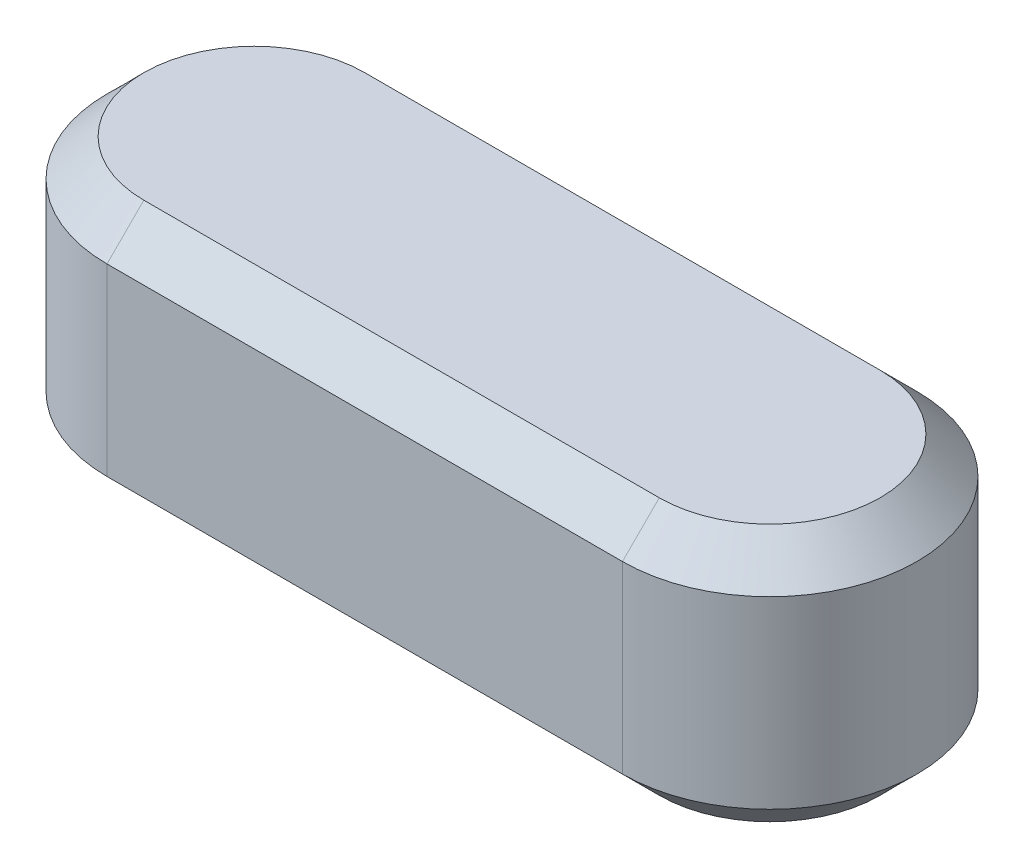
ISO-10303-21;
HEADER;
FILE_DESCRIPTION(('STEP AP214'),'2;1');
FILE_NAME('part.step','',(''),(''),'','','');
FILE_SCHEMA(('AUTOMOTIVE_DESIGN { 1 0 10303 214 1 1 1 1 }'));
ENDSEC;
DATA;
#1=APPLICATION_CONTEXT('core data for automotive mechanical design processes');
#2=APPLICATION_PROTOCOL_DEFINITION('international standard','automotive_design',2000,#1);
#3=PRODUCT_CONTEXT('',#1,'mechanical');
#4=PRODUCT('Part','Part','',(#3));
#5=PRODUCT_RELATED_PRODUCT_CATEGORY('part','',(#4));
#6=PRODUCT_DEFINITION_FORMATION('','',#4);
#7=PRODUCT_DEFINITION_CONTEXT('part definition',#1,'design');
#8=PRODUCT_DEFINITION('design','',#6,#7);
#9=PRODUCT_DEFINITION_SHAPE('','',#8);
#10=(LENGTH_UNIT() NAMED_UNIT(*) SI_UNIT(.MILLI.,.METRE.));
#11=(NAMED_UNIT(*) PLANE_ANGLE_UNIT() SI_UNIT($,.RADIAN.));
#12=(NAMED_UNIT(*) SI_UNIT($,.STERADIAN.) SOLID_ANGLE_UNIT());
#13=UNCERTAINTY_MEASURE_WITH_UNIT(LENGTH_MEASURE(1.E-05),#10,'distance_accuracy_value','');
#14=(GEOMETRIC_REPRESENTATION_CONTEXT(3) GLOBAL_UNCERTAINTY_ASSIGNED_CONTEXT((#13)) GLOBAL_UNIT_ASSIGNED_CONTEXT((#10,
#11,#12)) REPRESENTATION_CONTEXT('',''));
#15=CARTESIAN_POINT('',(0.,0.,0.));
#16=DIRECTION('',(0.,0.,1.));
#17=DIRECTION('',(1.,0.,0.));
#18=AXIS2_PLACEMENT_3D('',#15,#16,#17);
#19=CARTESIAN_POINT('',(0.,7.,0.));
#20=DIRECTION('',(0.,-1.,0.));
#21=DIRECTION('',(0.,0.,-1.));
#22=AXIS2_PLACEMENT_3D('',#19,#20,#21);
#23=CYLINDRICAL_SURFACE('',#22,4.);
#24=DIRECTION('',(0.,-1.,0.));
#25=VECTOR('',#24,1.);
#26=CARTESIAN_POINT('',(0.,7.,-4.));
#27=LINE('',#26,#25);
#28=CARTESIAN_POINT('',(0.,6.,-4.));
#29=VERTEX_POINT('',#28);
#30=CARTESIAN_POINT('',(0.,0.999999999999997,-4.));
#31=VERTEX_POINT('',#30);
#32=EDGE_CURVE('E106',#29,#31,#27,.T.);
#33=ORIENTED_EDGE('',*,*,#32,.T.);
#34=CARTESIAN_POINT('',(0.,0.999999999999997,0.));
#35=DIRECTION('',(0.,1.,0.));
#36=DIRECTION('',(0.,0.,1.));
#37=AXIS2_PLACEMENT_3D('',#34,#35,#36);
#38=CIRCLE('',#37,4.);
#39=CARTESIAN_POINT('',(0.,0.999999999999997,4.));
#40=VERTEX_POINT('',#39);
#41=EDGE_CURVE('E113',#31,#40,#38,.T.);
#42=ORIENTED_EDGE('',*,*,#41,.T.);
#43=DIRECTION('',(0.,-1.,0.));
#44=VECTOR('',#43,1.);
#45=CARTESIAN_POINT('',(0.,7.,4.));
#46=LINE('',#45,#44);
#47=CARTESIAN_POINT('',(0.,6.,4.));
#48=VERTEX_POINT('',#47);
#49=EDGE_CURVE('E108',#48,#40,#46,.T.);
#50=ORIENTED_EDGE('',*,*,#49,.F.);
#51=CARTESIAN_POINT('',(0.,6.,0.));
#52=DIRECTION('',(0.,1.,0.));
#53=DIRECTION('',(0.,0.,1.));
#54=AXIS2_PLACEMENT_3D('',#51,#52,#53);
#55=CIRCLE('',#54,4.);
#56=EDGE_CURVE('E104',#48,#29,#55,.F.);
#57=ORIENTED_EDGE('',*,*,#56,.T.);
#58=EDGE_LOOP('',(#33,#42,#50,#57));
#59=FACE_BOUND('',#58,.T.);
#60=ADVANCED_FACE('F34',(#59),#23,.T.);
#61=CARTESIAN_POINT('',(0.,7.,4.));
#62=DIRECTION('',(0.,0.,-1.));
#63=DIRECTION('',(-1.,0.,0.));
#64=AXIS2_PLACEMENT_3D('',#61,#62,#63);
#65=PLANE('',#64);
#66=ORIENTED_EDGE('',*,*,#49,.T.);
#67=DIRECTION('',(1.,0.,0.));
#68=VECTOR('',#67,1.);
#69=CARTESIAN_POINT('',(0.,0.999999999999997,4.));
#70=LINE('',#69,#68);
#71=CARTESIAN_POINT('',(14.,0.999999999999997,4.));
#72=VERTEX_POINT('',#71);
#73=EDGE_CURVE('E157',#40,#72,#70,.T.);
#74=ORIENTED_EDGE('',*,*,#73,.T.);
#75=DIRECTION('',(0.,-1.,0.));
#76=VECTOR('',#75,1.);
#77=CARTESIAN_POINT('',(14.,7.,4.));
#78=LINE('',#77,#76);
#79=CARTESIAN_POINT('',(14.,6.,4.));
#80=VERTEX_POINT('',#79);
#81=EDGE_CURVE('E138',#80,#72,#78,.T.);
#82=ORIENTED_EDGE('',*,*,#81,.F.);
#83=DIRECTION('',(-1.,0.,0.));
#84=VECTOR('',#83,1.);
#85=CARTESIAN_POINT('',(0.,6.,4.));
#86=LINE('',#85,#84);
#87=EDGE_CURVE('E155',#80,#48,#86,.T.);
#88=ORIENTED_EDGE('',*,*,#87,.T.);
#89=EDGE_LOOP('',(#66,#74,#82,#88));
#90=FACE_BOUND('',#89,.T.);
#91=ADVANCED_FACE('F182',(#90),#65,.F.);
#92=CARTESIAN_POINT('',(14.,7.,0.));
#93=DIRECTION('',(0.,-1.,0.));
#94=DIRECTION('',(0.,0.,-1.));
#95=AXIS2_PLACEMENT_3D('',#92,#93,#94);
#96=CYLINDRICAL_SURFACE('',#95,4.);
#97=ORIENTED_EDGE('',*,*,#81,.T.);
#98=CARTESIAN_POINT('',(14.,0.999999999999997,0.));
#99=DIRECTION('',(0.,1.,0.));
#100=DIRECTION('',(0.,0.,1.));
#101=AXIS2_PLACEMENT_3D('',#98,#99,#100);
#102=CIRCLE('',#101,4.);
#103=CARTESIAN_POINT('',(14.,0.999999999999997,-4.));
#104=VERTEX_POINT('',#103);
#105=EDGE_CURVE('E153',#72,#104,#102,.T.);
#106=ORIENTED_EDGE('',*,*,#105,.T.);
#107=DIRECTION('',(0.,-1.,0.));
#108=VECTOR('',#107,1.);
#109=CARTESIAN_POINT('',(14.,7.,-4.));
#110=LINE('',#109,#108);
#111=CARTESIAN_POINT('',(14.,6.,-4.));
#112=VERTEX_POINT('',#111);
#113=EDGE_CURVE('E125',#112,#104,#110,.T.);
#114=ORIENTED_EDGE('',*,*,#113,.F.);
#115=CARTESIAN_POINT('',(14.,6.,0.));
#116=DIRECTION('',(0.,1.,0.));
#117=DIRECTION('',(0.,0.,1.));
#118=AXIS2_PLACEMENT_3D('',#115,#116,#117);
#119=CIRCLE('',#118,4.);
#120=EDGE_CURVE('E150',#112,#80,#119,.F.);
#121=ORIENTED_EDGE('',*,*,#120,.T.);
#122=EDGE_LOOP('',(#97,#106,#114,#121));
#123=FACE_BOUND('',#122,.T.);
#124=ADVANCED_FACE('F180',(#123),#96,.T.);
#125=CARTESIAN_POINT('',(0.,7.,-4.));
#126=DIRECTION('',(0.,0.,1.));
#127=DIRECTION('',(1.,0.,0.));
#128=AXIS2_PLACEMENT_3D('',#125,#126,#127);
#129=PLANE('',#128);
#130=ORIENTED_EDGE('',*,*,#113,.T.);
#131=DIRECTION('',(-1.,0.,0.));
#132=VECTOR('',#131,1.);
#133=CARTESIAN_POINT('',(0.,0.999999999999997,-4.));
#134=LINE('',#133,#132);
#135=EDGE_CURVE('E124',#104,#31,#134,.T.);
#136=ORIENTED_EDGE('',*,*,#135,.T.);
#137=ORIENTED_EDGE('',*,*,#32,.F.);
#138=DIRECTION('',(1.,0.,0.));
#139=VECTOR('',#138,1.);
#140=CARTESIAN_POINT('',(14.,6.,-4.));
#141=LINE('',#140,#139);
#142=EDGE_CURVE('E121',#29,#112,#141,.T.);
#143=ORIENTED_EDGE('',*,*,#142,.T.);
#144=EDGE_LOOP('',(#130,#136,#137,#143));
#145=FACE_BOUND('',#144,.T.);
#146=ADVANCED_FACE('F119',(#145),#129,.F.);
#147=CARTESIAN_POINT('',(0.,7.,0.));
#148=DIRECTION('',(0.,1.,0.));
#149=DIRECTION('',(0.,0.,1.));
#150=AXIS2_PLACEMENT_3D('',#147,#148,#149);
#151=PLANE('',#150);
#152=DIRECTION('',(1.,0.,0.));
#153=VECTOR('',#152,1.);
#154=CARTESIAN_POINT('',(14.,7.,3.00000000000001));
#155=LINE('',#154,#153);
#156=CARTESIAN_POINT('',(0.,7.,3.00000000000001));
#157=VERTEX_POINT('',#156);
#158=CARTESIAN_POINT('',(14.,7.,3.00000000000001));
#159=VERTEX_POINT('',#158);
#160=EDGE_CURVE('E58',#157,#159,#155,.T.);
#161=ORIENTED_EDGE('',*,*,#160,.T.);
#162=CARTESIAN_POINT('',(14.,7.,0.));
#163=DIRECTION('',(0.,1.,0.));
#164=DIRECTION('',(0.,0.,1.));
#165=AXIS2_PLACEMENT_3D('',#162,#163,#164);
#166=CIRCLE('',#165,3.00000000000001);
#167=CARTESIAN_POINT('',(14.,7.,-3.00000000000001));
#168=VERTEX_POINT('',#167);
#169=EDGE_CURVE('E11',#159,#168,#166,.T.);
#170=ORIENTED_EDGE('',*,*,#169,.T.);
#171=DIRECTION('',(-1.,0.,0.));
#172=VECTOR('',#171,1.);
#173=CARTESIAN_POINT('',(0.,7.,-3.00000000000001));
#174=LINE('',#173,#172);
#175=CARTESIAN_POINT('',(0.,7.,-3.00000000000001));
#176=VERTEX_POINT('',#175);
#177=EDGE_CURVE('E43',#168,#176,#174,.T.);
#178=ORIENTED_EDGE('',*,*,#177,.T.);
#179=CARTESIAN_POINT('',(0.,7.,0.));
#180=DIRECTION('',(0.,1.,0.));
#181=DIRECTION('',(0.,0.,1.));
#182=AXIS2_PLACEMENT_3D('',#179,#180,#181);
#183=CIRCLE('',#182,3.00000000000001);
#184=EDGE_CURVE('E131',#176,#157,#183,.T.);
#185=ORIENTED_EDGE('',*,*,#184,.T.);
#186=EDGE_LOOP('',(#161,#170,#178,#185));
#187=FACE_BOUND('',#186,.T.);
#188=ADVANCED_FACE('F205',(#187),#151,.T.);
#189=CARTESIAN_POINT('',(0.,0.,0.));
#190=DIRECTION('',(0.,1.,0.));
#191=DIRECTION('',(0.,0.,1.));
#192=AXIS2_PLACEMENT_3D('',#189,#190,#191);
#193=PLANE('',#192);
#194=CARTESIAN_POINT('',(0.,0.,0.));
#195=DIRECTION('',(0.,1.,0.));
#196=DIRECTION('',(0.,0.,1.));
#197=AXIS2_PLACEMENT_3D('',#194,#195,#196);
#198=CIRCLE('',#197,3.);
#199=CARTESIAN_POINT('',(0.,0.,3.));
#200=VERTEX_POINT('',#199);
#201=CARTESIAN_POINT('',(0.,0.,-3.));
#202=VERTEX_POINT('',#201);
#203=EDGE_CURVE('E145',#200,#202,#198,.F.);
#204=ORIENTED_EDGE('',*,*,#203,.T.);
#205=DIRECTION('',(1.,0.,0.));
#206=VECTOR('',#205,1.);
#207=CARTESIAN_POINT('',(0.,0.,-3.));
#208=LINE('',#207,#206);
#209=CARTESIAN_POINT('',(14.,0.,-3.));
#210=VERTEX_POINT('',#209);
#211=EDGE_CURVE('E114',#202,#210,#208,.T.);
#212=ORIENTED_EDGE('',*,*,#211,.T.);
#213=CARTESIAN_POINT('',(14.,0.,0.));
#214=DIRECTION('',(0.,1.,0.));
#215=DIRECTION('',(0.,0.,1.));
#216=AXIS2_PLACEMENT_3D('',#213,#214,#215);
#217=CIRCLE('',#216,3.);
#218=CARTESIAN_POINT('',(14.,0.,3.));
#219=VERTEX_POINT('',#218);
#220=EDGE_CURVE('E143',#210,#219,#217,.F.);
#221=ORIENTED_EDGE('',*,*,#220,.T.);
#222=DIRECTION('',(-1.,0.,0.));
#223=VECTOR('',#222,1.);
#224=CARTESIAN_POINT('',(0.,0.,3.));
#225=LINE('',#224,#223);
#226=EDGE_CURVE('E136',#219,#200,#225,.T.);
#227=ORIENTED_EDGE('',*,*,#226,.T.);
#228=EDGE_LOOP('',(#204,#212,#221,#227));
#229=FACE_BOUND('',#228,.T.);
#230=ADVANCED_FACE('F203',(#229),#193,.F.);
#231=CARTESIAN_POINT('',(0.,0.999999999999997,4.));
#232=DIRECTION('',(0.,0.70710678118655,-0.707106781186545));
#233=DIRECTION('',(1.,0.,0.));
#234=AXIS2_PLACEMENT_3D('',#231,#232,#233);
#235=PLANE('',#234);
#236=DIRECTION('',(0.,0.707106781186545,0.70710678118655));
#237=VECTOR('',#236,1.);
#238=CARTESIAN_POINT('',(0.,0.,3.));
#239=LINE('',#238,#237);
#240=EDGE_CURVE('E166',#200,#40,#239,.T.);
#241=ORIENTED_EDGE('',*,*,#240,.F.);
#242=ORIENTED_EDGE('',*,*,#226,.F.);
#243=DIRECTION('',(0.,-0.707106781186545,-0.70710678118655));
#244=VECTOR('',#243,1.);
#245=CARTESIAN_POINT('',(14.,0.999999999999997,4.));
#246=LINE('',#245,#244);
#247=EDGE_CURVE('E126',#72,#219,#246,.T.);
#248=ORIENTED_EDGE('',*,*,#247,.F.);
#249=ORIENTED_EDGE('',*,*,#73,.F.);
#250=EDGE_LOOP('',(#241,#242,#248,#249));
#251=FACE_BOUND('',#250,.T.);
#252=ADVANCED_FACE('F200',(#251),#235,.F.);
#253=CARTESIAN_POINT('',(14.,0.999999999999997,0.));
#254=DIRECTION('',(0.,1.,0.));
#255=DIRECTION('',(0.,0.,1.));
#256=AXIS2_PLACEMENT_3D('',#253,#254,#255);
#257=CONICAL_SURFACE('',#256,4.,0.785398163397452);
#258=ORIENTED_EDGE('',*,*,#247,.T.);
#259=ORIENTED_EDGE('',*,*,#220,.F.);
#260=DIRECTION('',(0.,-0.707106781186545,0.70710678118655));
#261=VECTOR('',#260,1.);
#262=CARTESIAN_POINT('',(14.,0.999999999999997,-4.));
#263=LINE('',#262,#261);
#264=EDGE_CURVE('E164',#104,#210,#263,.T.);
#265=ORIENTED_EDGE('',*,*,#264,.F.);
#266=ORIENTED_EDGE('',*,*,#105,.F.);
#267=EDGE_LOOP('',(#258,#259,#265,#266));
#268=FACE_BOUND('',#267,.T.);
#269=ADVANCED_FACE('F189',(#268),#257,.T.);
#270=CARTESIAN_POINT('',(0.,0.999999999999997,0.));
#271=DIRECTION('',(0.,1.,0.));
#272=DIRECTION('',(0.,0.,1.));
#273=AXIS2_PLACEMENT_3D('',#270,#271,#272);
#274=CONICAL_SURFACE('',#273,4.,0.785398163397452);
#275=ORIENTED_EDGE('',*,*,#240,.T.);
#276=ORIENTED_EDGE('',*,*,#41,.F.);
#277=DIRECTION('',(0.,0.707106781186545,-0.70710678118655));
#278=VECTOR('',#277,1.);
#279=CARTESIAN_POINT('',(0.,0.,-3.));
#280=LINE('',#279,#278);
#281=EDGE_CURVE('E162',#202,#31,#280,.T.);
#282=ORIENTED_EDGE('',*,*,#281,.F.);
#283=ORIENTED_EDGE('',*,*,#203,.F.);
#284=EDGE_LOOP('',(#275,#276,#282,#283));
#285=FACE_BOUND('',#284,.T.);
#286=ADVANCED_FACE('F197',(#285),#274,.T.);
#287=CARTESIAN_POINT('',(0.,0.999999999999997,-4.));
#288=DIRECTION('',(0.,0.70710678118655,0.707106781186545));
#289=DIRECTION('',(-1.,0.,0.));
#290=AXIS2_PLACEMENT_3D('',#287,#288,#289);
#291=PLANE('',#290);
#292=ORIENTED_EDGE('',*,*,#264,.T.);
#293=ORIENTED_EDGE('',*,*,#211,.F.);
#294=ORIENTED_EDGE('',*,*,#281,.T.);
#295=ORIENTED_EDGE('',*,*,#135,.F.);
#296=EDGE_LOOP('',(#292,#293,#294,#295));
#297=FACE_BOUND('',#296,.T.);
#298=ADVANCED_FACE('F192',(#297),#291,.F.);
#299=CARTESIAN_POINT('',(0.,7.,0.));
#300=DIRECTION('',(0.,-1.,0.));
#301=DIRECTION('',(0.,0.,-1.));
#302=AXIS2_PLACEMENT_3D('',#299,#300,#301);
#303=CONICAL_SURFACE('',#302,3.00000000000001,0.785398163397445);
#304=DIRECTION('',(0.,0.70710678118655,0.707106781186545));
#305=VECTOR('',#304,1.);
#306=CARTESIAN_POINT('',(0.,6.,-4.));
#307=LINE('',#306,#305);
#308=EDGE_CURVE('E130',#29,#176,#307,.T.);
#309=ORIENTED_EDGE('',*,*,#308,.F.);
#310=ORIENTED_EDGE('',*,*,#56,.F.);
#311=DIRECTION('',(0.,-0.70710678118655,0.707106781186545));
#312=VECTOR('',#311,1.);
#313=CARTESIAN_POINT('',(0.,7.,3.00000000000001));
#314=LINE('',#313,#312);
#315=EDGE_CURVE('E38',#157,#48,#314,.T.);
#316=ORIENTED_EDGE('',*,*,#315,.F.);
#317=ORIENTED_EDGE('',*,*,#184,.F.);
#318=EDGE_LOOP('',(#309,#310,#316,#317));
#319=FACE_BOUND('',#318,.T.);
#320=ADVANCED_FACE('F36',(#319),#303,.T.);
#321=CARTESIAN_POINT('',(0.,7.,3.00000000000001));
#322=DIRECTION('',(0.,0.707106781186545,0.70710678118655));
#323=DIRECTION('',(-1.,0.,0.));
#324=AXIS2_PLACEMENT_3D('',#321,#322,#323);
#325=PLANE('',#324);
#326=ORIENTED_EDGE('',*,*,#315,.T.);
#327=ORIENTED_EDGE('',*,*,#87,.F.);
#328=DIRECTION('',(0.,-0.70710678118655,0.707106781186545));
#329=VECTOR('',#328,1.);
#330=CARTESIAN_POINT('',(14.,7.,3.00000000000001));
#331=LINE('',#330,#329);
#332=EDGE_CURVE('E133',#159,#80,#331,.T.);
#333=ORIENTED_EDGE('',*,*,#332,.F.);
#334=ORIENTED_EDGE('',*,*,#160,.F.);
#335=EDGE_LOOP('',(#326,#327,#333,#334));
#336=FACE_BOUND('',#335,.T.);
#337=ADVANCED_FACE('F175',(#336),#325,.T.);
#338=CARTESIAN_POINT('',(0.,7.,-3.00000000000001));
#339=DIRECTION('',(0.,0.707106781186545,-0.70710678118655));
#340=DIRECTION('',(1.,0.,0.));
#341=AXIS2_PLACEMENT_3D('',#338,#339,#340);
#342=PLANE('',#341);
#343=ORIENTED_EDGE('',*,*,#308,.T.);
#344=ORIENTED_EDGE('',*,*,#177,.F.);
#345=DIRECTION('',(0.,0.70710678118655,0.707106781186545));
#346=VECTOR('',#345,1.);
#347=CARTESIAN_POINT('',(14.,6.,-4.));
#348=LINE('',#347,#346);
#349=EDGE_CURVE('E51',#112,#168,#348,.T.);
#350=ORIENTED_EDGE('',*,*,#349,.F.);
#351=ORIENTED_EDGE('',*,*,#142,.F.);
#352=EDGE_LOOP('',(#343,#344,#350,#351));
#353=FACE_BOUND('',#352,.T.);
#354=ADVANCED_FACE('F134',(#353),#342,.T.);
#355=CARTESIAN_POINT('',(14.,7.,0.));
#356=DIRECTION('',(0.,-1.,0.));
#357=DIRECTION('',(0.,0.,-1.));
#358=AXIS2_PLACEMENT_3D('',#355,#356,#357);
#359=CONICAL_SURFACE('',#358,3.00000000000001,0.785398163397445);
#360=ORIENTED_EDGE('',*,*,#332,.T.);
#361=ORIENTED_EDGE('',*,*,#120,.F.);
#362=ORIENTED_EDGE('',*,*,#349,.T.);
#363=ORIENTED_EDGE('',*,*,#169,.F.);
#364=EDGE_LOOP('',(#360,#361,#362,#363));
#365=FACE_BOUND('',#364,.T.);
#366=ADVANCED_FACE('F173',(#365),#359,.T.);
#367=CLOSED_SHELL('',(#60,#91,#124,#146,#188,#230,#252,#269,#286,#298,#320,#337,#354,#366));
#368=MANIFOLD_SOLID_BREP('B2',#367);
#369=ADVANCED_BREP_SHAPE_REPRESENTATION('',(#18,#368),#14);
#370=SHAPE_DEFINITION_REPRESENTATION(#9,#369);
ENDSEC;
END-ISO-10303-21;
